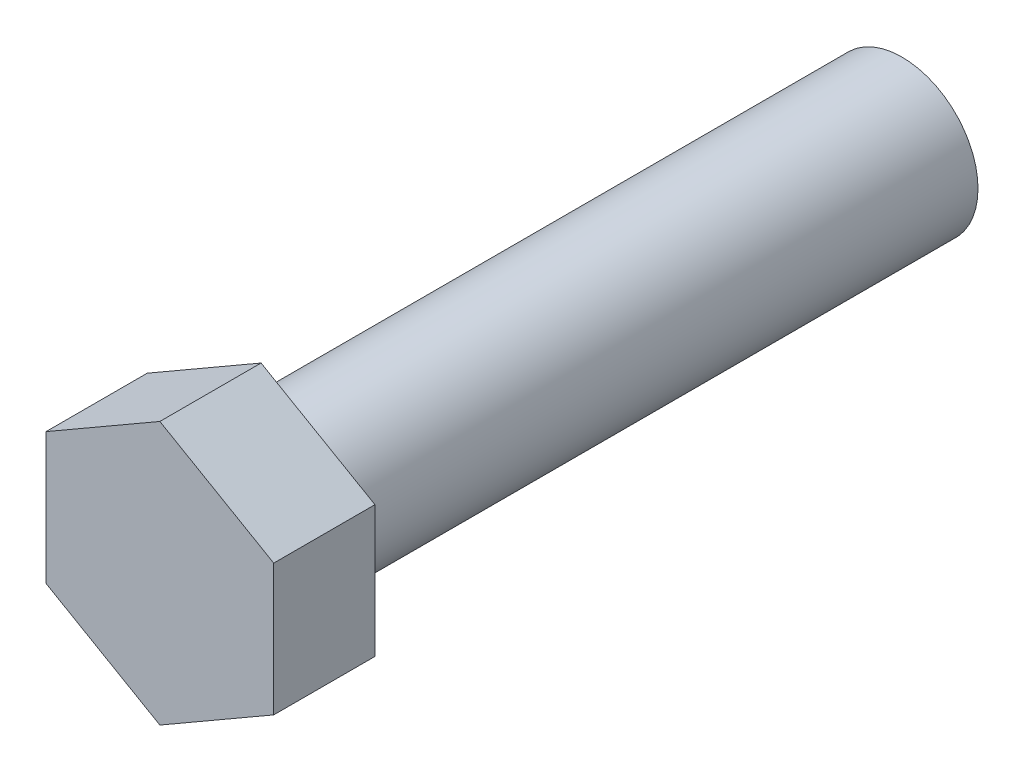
from build123d import *

# Parameters (mm, degrees)
BOLT_HEAD_DEPTH = 38.1
SK_BODY_R       = 28.575
BOLT_BODY_DEPTH = 241.3


with BuildPart() as part:
    # Sketch3 → bolt Head (new body)
    with BuildSketch(Plane(origin=(0, 0, 0), x_dir=(0, 1, 0), z_dir=(0, 0, 1))):
        Polygon((49.493351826, 0), (24.746675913, 42.8625), (-24.746675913, 42.8625), (-49.493351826, 0), (-24.746675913, -42.8625), (24.746675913, -42.8625), align=None)
    extrude(amount=BOLT_HEAD_DEPTH)

    # sk body → bolt Body (add)
    with BuildSketch(Plane(origin=(0, 0, 0), x_dir=(0, 1, 0), z_dir=(0, 0, 1))):
        with Locations(Location((0, 0, 0), (0, 0, 270))):
            Circle(SK_BODY_R)
    extrude(amount=-BOLT_BODY_DEPTH)


solid = part.part
